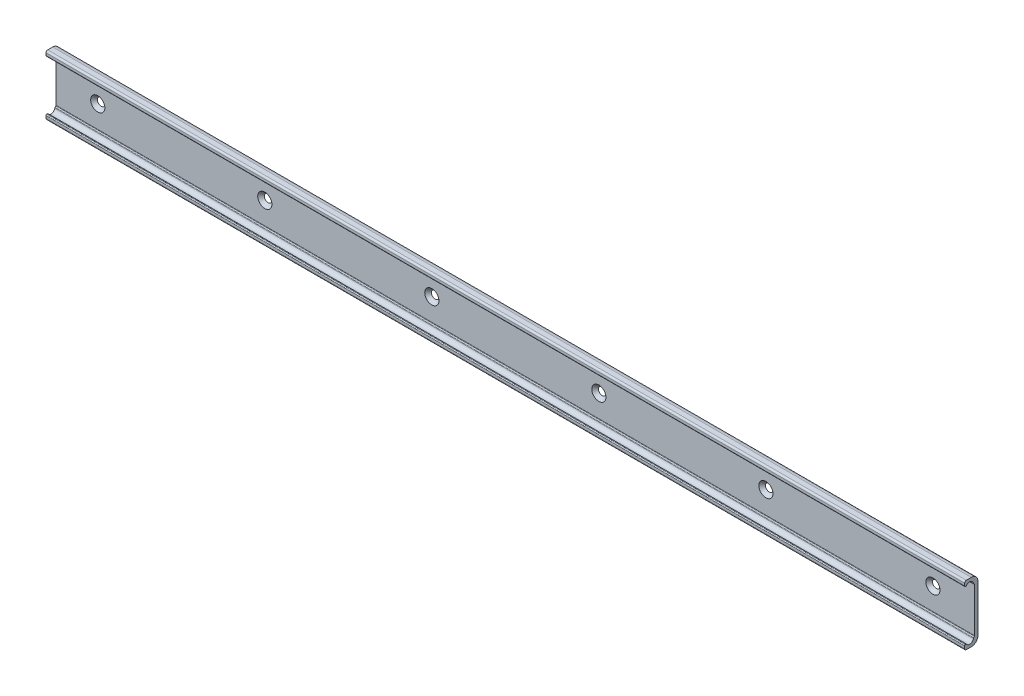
ISO-10303-21;
HEADER;
FILE_DESCRIPTION(('STEP AP214'),'2;1');
FILE_NAME('part.step','',(''),(''),'','','');
FILE_SCHEMA(('AUTOMOTIVE_DESIGN { 1 0 10303 214 1 1 1 1 }'));
ENDSEC;
DATA;
#1=APPLICATION_CONTEXT('core data for automotive mechanical design processes');
#2=APPLICATION_PROTOCOL_DEFINITION('international standard','automotive_design',2000,#1);
#3=PRODUCT_CONTEXT('',#1,'mechanical');
#4=PRODUCT('Part','Part','',(#3));
#5=PRODUCT_RELATED_PRODUCT_CATEGORY('part','',(#4));
#6=PRODUCT_DEFINITION_FORMATION('','',#4);
#7=PRODUCT_DEFINITION_CONTEXT('part definition',#1,'design');
#8=PRODUCT_DEFINITION('design','',#6,#7);
#9=PRODUCT_DEFINITION_SHAPE('','',#8);
#10=(LENGTH_UNIT() NAMED_UNIT(*) SI_UNIT(.MILLI.,.METRE.));
#11=(NAMED_UNIT(*) PLANE_ANGLE_UNIT() SI_UNIT($,.RADIAN.));
#12=(NAMED_UNIT(*) SI_UNIT($,.STERADIAN.) SOLID_ANGLE_UNIT());
#13=UNCERTAINTY_MEASURE_WITH_UNIT(LENGTH_MEASURE(1.E-05),#10,'distance_accuracy_value','');
#14=(GEOMETRIC_REPRESENTATION_CONTEXT(3) GLOBAL_UNCERTAINTY_ASSIGNED_CONTEXT((#13)) GLOBAL_UNIT_ASSIGNED_CONTEXT((#10,
#11,#12)) REPRESENTATION_CONTEXT('',''));
#15=CARTESIAN_POINT('',(0.,0.,0.));
#16=DIRECTION('',(0.,0.,1.));
#17=DIRECTION('',(1.,0.,0.));
#18=AXIS2_PLACEMENT_3D('',#15,#16,#17);
#19=CARTESIAN_POINT('',(525.,14.,4.));
#20=DIRECTION('',(-1.,0.,0.));
#21=DIRECTION('',(0.,0.,1.));
#22=AXIS2_PLACEMENT_3D('',#19,#20,#21);
#23=CYLINDRICAL_SURFACE('',#22,4.);
#24=CARTESIAN_POINT('',(-25.,14.,4.));
#25=DIRECTION('',(-1.,0.,0.));
#26=DIRECTION('',(0.,0.,1.));
#27=AXIS2_PLACEMENT_3D('',#24,#25,#26);
#28=CIRCLE('',#27,4.);
#29=CARTESIAN_POINT('',(-25.,18.,4.));
#30=VERTEX_POINT('',#29);
#31=CARTESIAN_POINT('',(-25.,14.,0.));
#32=VERTEX_POINT('',#31);
#33=EDGE_CURVE('E174',#30,#32,#28,.T.);
#34=ORIENTED_EDGE('',*,*,#33,.F.);
#35=DIRECTION('',(-1.,0.,0.));
#36=VECTOR('',#35,1.);
#37=CARTESIAN_POINT('',(525.,18.,4.));
#38=LINE('',#37,#36);
#39=CARTESIAN_POINT('',(525.,18.,4.));
#40=VERTEX_POINT('',#39);
#41=EDGE_CURVE('E9',#40,#30,#38,.T.);
#42=ORIENTED_EDGE('',*,*,#41,.F.);
#43=CARTESIAN_POINT('',(525.,14.,4.));
#44=DIRECTION('',(-1.,0.,0.));
#45=DIRECTION('',(0.,0.,1.));
#46=AXIS2_PLACEMENT_3D('',#43,#44,#45);
#47=CIRCLE('',#46,4.);
#48=CARTESIAN_POINT('',(525.,14.,0.));
#49=VERTEX_POINT('',#48);
#50=EDGE_CURVE('E176',#40,#49,#47,.T.);
#51=ORIENTED_EDGE('',*,*,#50,.T.);
#52=DIRECTION('',(-1.,0.,0.));
#53=VECTOR('',#52,1.);
#54=CARTESIAN_POINT('',(525.,14.,0.));
#55=LINE('',#54,#53);
#56=EDGE_CURVE('E17',#49,#32,#55,.T.);
#57=ORIENTED_EDGE('',*,*,#56,.T.);
#58=EDGE_LOOP('',(#34,#42,#51,#57));
#59=FACE_BOUND('',#58,.T.);
#60=ADVANCED_FACE('F14',(#59),#23,.T.);
#61=CARTESIAN_POINT('',(525.,18.,7.));
#62=DIRECTION('',(0.,1.,0.));
#63=DIRECTION('',(-1.,0.,0.));
#64=AXIS2_PLACEMENT_3D('',#61,#62,#63);
#65=PLANE('',#64);
#66=DIRECTION('',(0.,0.,-1.));
#67=VECTOR('',#66,1.);
#68=CARTESIAN_POINT('',(-25.,18.,7.));
#69=LINE('',#68,#67);
#70=CARTESIAN_POINT('',(-25.,18.,7.));
#71=VERTEX_POINT('',#70);
#72=EDGE_CURVE('E192',#71,#30,#69,.T.);
#73=ORIENTED_EDGE('',*,*,#72,.F.);
#74=DIRECTION('',(-1.,0.,0.));
#75=VECTOR('',#74,1.);
#76=CARTESIAN_POINT('',(525.,18.,7.));
#77=LINE('',#76,#75);
#78=CARTESIAN_POINT('',(525.,18.,7.));
#79=VERTEX_POINT('',#78);
#80=EDGE_CURVE('E22',#79,#71,#77,.T.);
#81=ORIENTED_EDGE('',*,*,#80,.F.);
#82=DIRECTION('',(0.,0.,-1.));
#83=VECTOR('',#82,1.);
#84=CARTESIAN_POINT('',(525.,18.,7.));
#85=LINE('',#84,#83);
#86=EDGE_CURVE('E181',#79,#40,#85,.T.);
#87=ORIENTED_EDGE('',*,*,#86,.T.);
#88=ORIENTED_EDGE('',*,*,#41,.T.);
#89=EDGE_LOOP('',(#73,#81,#87,#88));
#90=FACE_BOUND('',#89,.T.);
#91=ADVANCED_FACE('F448',(#90),#65,.T.);
#92=CARTESIAN_POINT('',(525.,17.,7.));
#93=DIRECTION('',(-1.,0.,0.));
#94=DIRECTION('',(0.,0.,1.));
#95=AXIS2_PLACEMENT_3D('',#92,#93,#94);
#96=CYLINDRICAL_SURFACE('',#95,1.);
#97=CARTESIAN_POINT('',(-25.,17.,7.));
#98=DIRECTION('',(-1.,0.,0.));
#99=DIRECTION('',(0.,0.,1.));
#100=AXIS2_PLACEMENT_3D('',#97,#98,#99);
#101=CIRCLE('',#100,1.);
#102=CARTESIAN_POINT('',(-25.,17.,8.));
#103=VERTEX_POINT('',#102);
#104=EDGE_CURVE('E258',#103,#71,#101,.T.);
#105=ORIENTED_EDGE('',*,*,#104,.F.);
#106=DIRECTION('',(-1.,0.,0.));
#107=VECTOR('',#106,1.);
#108=CARTESIAN_POINT('',(525.,17.,8.));
#109=LINE('',#108,#107);
#110=CARTESIAN_POINT('',(525.,17.,8.));
#111=VERTEX_POINT('',#110);
#112=EDGE_CURVE('E328',#111,#103,#109,.T.);
#113=ORIENTED_EDGE('',*,*,#112,.F.);
#114=CARTESIAN_POINT('',(525.,17.,7.));
#115=DIRECTION('',(-1.,0.,0.));
#116=DIRECTION('',(0.,0.,1.));
#117=AXIS2_PLACEMENT_3D('',#114,#115,#116);
#118=CIRCLE('',#117,1.);
#119=EDGE_CURVE('E324',#111,#79,#118,.T.);
#120=ORIENTED_EDGE('',*,*,#119,.T.);
#121=ORIENTED_EDGE('',*,*,#80,.T.);
#122=EDGE_LOOP('',(#105,#113,#120,#121));
#123=FACE_BOUND('',#122,.T.);
#124=ADVANCED_FACE('F453',(#123),#96,.T.);
#125=CARTESIAN_POINT('',(525.,15.55,8.));
#126=DIRECTION('',(0.,0.,1.));
#127=DIRECTION('',(1.,0.,0.));
#128=AXIS2_PLACEMENT_3D('',#125,#126,#127);
#129=PLANE('',#128);
#130=DIRECTION('',(0.,1.,0.));
#131=VECTOR('',#130,1.);
#132=CARTESIAN_POINT('',(-25.,15.55,8.));
#133=LINE('',#132,#131);
#134=CARTESIAN_POINT('',(-25.,15.55,8.));
#135=VERTEX_POINT('',#134);
#136=EDGE_CURVE('E255',#135,#103,#133,.T.);
#137=ORIENTED_EDGE('',*,*,#136,.F.);
#138=DIRECTION('',(-1.,0.,0.));
#139=VECTOR('',#138,1.);
#140=CARTESIAN_POINT('',(525.,15.55,8.));
#141=LINE('',#140,#139);
#142=CARTESIAN_POINT('',(525.,15.55,8.));
#143=VERTEX_POINT('',#142);
#144=EDGE_CURVE('E330',#143,#135,#141,.T.);
#145=ORIENTED_EDGE('',*,*,#144,.F.);
#146=DIRECTION('',(0.,1.,0.));
#147=VECTOR('',#146,1.);
#148=CARTESIAN_POINT('',(525.,15.55,8.));
#149=LINE('',#148,#147);
#150=EDGE_CURVE('E321',#143,#111,#149,.T.);
#151=ORIENTED_EDGE('',*,*,#150,.T.);
#152=ORIENTED_EDGE('',*,*,#112,.T.);
#153=EDGE_LOOP('',(#137,#145,#151,#152));
#154=FACE_BOUND('',#153,.T.);
#155=ADVANCED_FACE('F445',(#154),#129,.T.);
#156=CARTESIAN_POINT('',(525.,15.5499998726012,7.5));
#157=DIRECTION('',(-1.,0.,0.));
#158=DIRECTION('',(0.,0.,1.));
#159=AXIS2_PLACEMENT_3D('',#156,#157,#158);
#160=CYLINDRICAL_SURFACE('',#159,0.500000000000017);
#161=CARTESIAN_POINT('',(-25.,15.5499998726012,7.5));
#162=DIRECTION('',(-1.,0.,0.));
#163=DIRECTION('',(0.,0.,1.));
#164=AXIS2_PLACEMENT_3D('',#161,#162,#163);
#165=CIRCLE('',#164,0.500000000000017);
#166=CARTESIAN_POINT('',(-25.,15.0499998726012,7.49999995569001));
#167=VERTEX_POINT('',#166);
#168=EDGE_CURVE('E252',#167,#135,#165,.T.);
#169=ORIENTED_EDGE('',*,*,#168,.F.);
#170=DIRECTION('',(-1.,0.,0.));
#171=VECTOR('',#170,1.);
#172=CARTESIAN_POINT('',(525.,15.0499998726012,7.49999995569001));
#173=LINE('',#172,#171);
#174=CARTESIAN_POINT('',(525.,15.0499998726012,7.49999995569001));
#175=VERTEX_POINT('',#174);
#176=EDGE_CURVE('E332',#175,#167,#173,.T.);
#177=ORIENTED_EDGE('',*,*,#176,.F.);
#178=CARTESIAN_POINT('',(525.,15.5499998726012,7.5));
#179=DIRECTION('',(-1.,0.,0.));
#180=DIRECTION('',(0.,0.,1.));
#181=AXIS2_PLACEMENT_3D('',#178,#179,#180);
#182=CIRCLE('',#181,0.500000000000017);
#183=EDGE_CURVE('E318',#175,#143,#182,.T.);
#184=ORIENTED_EDGE('',*,*,#183,.T.);
#185=ORIENTED_EDGE('',*,*,#144,.T.);
#186=EDGE_LOOP('',(#169,#177,#184,#185));
#187=FACE_BOUND('',#186,.T.);
#188=ADVANCED_FACE('F441',(#187),#160,.T.);
#189=CARTESIAN_POINT('',(525.,15.0499998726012,7.49999995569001));
#190=DIRECTION('',(0.,-1.,0.));
#191=DIRECTION('',(1.,0.,0.));
#192=AXIS2_PLACEMENT_3D('',#189,#190,#191);
#193=PLANE('',#192);
#194=DIRECTION('',(0.,0.,1.));
#195=VECTOR('',#194,1.);
#196=CARTESIAN_POINT('',(-25.,15.0499998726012,7.49999995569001));
#197=LINE('',#196,#195);
#198=CARTESIAN_POINT('',(-25.,15.0499998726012,6.99185845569));
#199=VERTEX_POINT('',#198);
#200=EDGE_CURVE('E249',#199,#167,#197,.T.);
#201=ORIENTED_EDGE('',*,*,#200,.F.);
#202=DIRECTION('',(-1.,0.,0.));
#203=VECTOR('',#202,1.);
#204=CARTESIAN_POINT('',(525.,15.0499998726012,6.99185845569));
#205=LINE('',#204,#203);
#206=CARTESIAN_POINT('',(525.,15.0499998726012,6.99185845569));
#207=VERTEX_POINT('',#206);
#208=EDGE_CURVE('E334',#207,#199,#205,.T.);
#209=ORIENTED_EDGE('',*,*,#208,.F.);
#210=DIRECTION('',(0.,0.,1.));
#211=VECTOR('',#210,1.);
#212=CARTESIAN_POINT('',(525.,15.0499998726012,7.49999995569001));
#213=LINE('',#212,#211);
#214=EDGE_CURVE('E315',#207,#175,#213,.T.);
#215=ORIENTED_EDGE('',*,*,#214,.T.);
#216=ORIENTED_EDGE('',*,*,#176,.T.);
#217=EDGE_LOOP('',(#201,#209,#215,#216));
#218=FACE_BOUND('',#217,.T.);
#219=ADVANCED_FACE('F437',(#218),#193,.T.);
#220=CARTESIAN_POINT('',(525.,13.899999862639,4.99999993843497));
#221=DIRECTION('',(-1.,0.,0.));
#222=DIRECTION('',(0.,0.,1.));
#223=AXIS2_PLACEMENT_3D('',#220,#221,#222);
#224=CYLINDRICAL_SURFACE('',#223,2.30000008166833);
#225=CARTESIAN_POINT('',(-25.,13.899999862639,4.99999993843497));
#226=DIRECTION('',(1.,0.,0.));
#227=DIRECTION('',(0.,0.,1.));
#228=AXIS2_PLACEMENT_3D('',#225,#226,#227);
#229=CIRCLE('',#228,2.30000008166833);
#230=CARTESIAN_POINT('',(-25.,14.3822673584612,2.75112945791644));
#231=VERTEX_POINT('',#230);
#232=EDGE_CURVE('E246',#231,#199,#229,.T.);
#233=ORIENTED_EDGE('',*,*,#232,.F.);
#234=DIRECTION('',(-1.,0.,0.));
#235=VECTOR('',#234,1.);
#236=CARTESIAN_POINT('',(525.,14.3822673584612,2.75112945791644));
#237=LINE('',#236,#235);
#238=CARTESIAN_POINT('',(525.,14.3822673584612,2.75112945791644));
#239=VERTEX_POINT('',#238);
#240=EDGE_CURVE('E336',#239,#231,#237,.T.);
#241=ORIENTED_EDGE('',*,*,#240,.F.);
#242=CARTESIAN_POINT('',(525.,13.899999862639,4.99999993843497));
#243=DIRECTION('',(1.,0.,0.));
#244=DIRECTION('',(0.,0.,1.));
#245=AXIS2_PLACEMENT_3D('',#242,#243,#244);
#246=CIRCLE('',#245,2.30000008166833);
#247=EDGE_CURVE('E312',#239,#207,#246,.T.);
#248=ORIENTED_EDGE('',*,*,#247,.T.);
#249=ORIENTED_EDGE('',*,*,#208,.T.);
#250=EDGE_LOOP('',(#233,#241,#248,#249));
#251=FACE_BOUND('',#250,.T.);
#252=ADVANCED_FACE('F433',(#251),#224,.F.);
#253=CARTESIAN_POINT('',(525.,14.2647621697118,2.72240648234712));
#254=DIRECTION('',(0.,-0.237449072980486,0.971399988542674));
#255=DIRECTION('',(0.,0.971399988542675,0.237449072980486));
#256=AXIS2_PLACEMENT_3D('',#253,#254,#255);
#257=PLANE('',#256);
#258=DIRECTION('',(0.,0.971399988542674,0.237449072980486));
#259=VECTOR('',#258,1.);
#260=CARTESIAN_POINT('',(-25.,14.2647621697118,2.72240648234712));
#261=LINE('',#260,#259);
#262=CARTESIAN_POINT('',(-25.,14.2647621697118,2.72240648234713));
#263=VERTEX_POINT('',#262);
#264=EDGE_CURVE('E243',#263,#231,#261,.T.);
#265=ORIENTED_EDGE('',*,*,#264,.F.);
#266=DIRECTION('',(-1.,0.,0.));
#267=VECTOR('',#266,1.);
#268=CARTESIAN_POINT('',(525.,14.2647621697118,2.72240648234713));
#269=LINE('',#268,#267);
#270=CARTESIAN_POINT('',(525.,14.2647621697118,2.72240648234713));
#271=VERTEX_POINT('',#270);
#272=EDGE_CURVE('E338',#271,#263,#269,.T.);
#273=ORIENTED_EDGE('',*,*,#272,.F.);
#274=DIRECTION('',(0.,0.971399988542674,0.237449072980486));
#275=VECTOR('',#274,1.);
#276=CARTESIAN_POINT('',(525.,14.2647621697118,2.72240648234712));
#277=LINE('',#276,#275);
#278=EDGE_CURVE('E309',#271,#239,#277,.T.);
#279=ORIENTED_EDGE('',*,*,#278,.T.);
#280=ORIENTED_EDGE('',*,*,#240,.T.);
#281=EDGE_LOOP('',(#265,#273,#279,#280));
#282=FACE_BOUND('',#281,.T.);
#283=ADVANCED_FACE('F429',(#282),#257,.T.);
#284=CARTESIAN_POINT('',(525.,14.3343843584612,2.2272774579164));
#285=DIRECTION('',(-1.,0.,0.));
#286=DIRECTION('',(0.,0.,1.));
#287=AXIS2_PLACEMENT_3D('',#284,#285,#286);
#288=CYLINDRICAL_SURFACE('',#287,0.49999999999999);
#289=CARTESIAN_POINT('',(-25.,14.3343843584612,2.2272774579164));
#290=DIRECTION('',(-1.,0.,0.));
#291=DIRECTION('',(0.,0.,1.));
#292=AXIS2_PLACEMENT_3D('',#289,#290,#291);
#293=CIRCLE('',#292,0.49999999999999);
#294=CARTESIAN_POINT('',(-25.,13.980830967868,2.58083084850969));
#295=VERTEX_POINT('',#294);
#296=EDGE_CURVE('E240',#295,#263,#293,.T.);
#297=ORIENTED_EDGE('',*,*,#296,.F.);
#298=DIRECTION('',(-1.,0.,0.));
#299=VECTOR('',#298,1.);
#300=CARTESIAN_POINT('',(525.,13.980830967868,2.58083084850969));
#301=LINE('',#300,#299);
#302=CARTESIAN_POINT('',(525.,13.980830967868,2.58083084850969));
#303=VERTEX_POINT('',#302);
#304=EDGE_CURVE('E340',#303,#295,#301,.T.);
#305=ORIENTED_EDGE('',*,*,#304,.F.);
#306=CARTESIAN_POINT('',(525.,14.3343843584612,2.2272774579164));
#307=DIRECTION('',(-1.,0.,0.));
#308=DIRECTION('',(0.,0.,1.));
#309=AXIS2_PLACEMENT_3D('',#306,#307,#308);
#310=CIRCLE('',#309,0.49999999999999);
#311=EDGE_CURVE('E306',#303,#271,#310,.T.);
#312=ORIENTED_EDGE('',*,*,#311,.T.);
#313=ORIENTED_EDGE('',*,*,#272,.T.);
#314=EDGE_LOOP('',(#297,#305,#312,#313));
#315=FACE_BOUND('',#314,.T.);
#316=ADVANCED_FACE('F425',(#315),#288,.T.);
#317=CARTESIAN_POINT('',(525.,13.5464468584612,2.1464464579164));
#318=DIRECTION('',(0.,-0.707107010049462,0.707106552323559));
#319=DIRECTION('',(0.,0.707106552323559,0.707107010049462));
#320=AXIS2_PLACEMENT_3D('',#317,#318,#319);
#321=PLANE('',#320);
#322=DIRECTION('',(0.,0.707106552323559,0.707107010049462));
#323=VECTOR('',#322,1.);
#324=CARTESIAN_POINT('',(-25.,13.5464468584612,2.1464464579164));
#325=LINE('',#324,#323);
#326=CARTESIAN_POINT('',(-25.,13.5464468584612,2.1464464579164));
#327=VERTEX_POINT('',#326);
#328=EDGE_CURVE('E237',#327,#295,#325,.T.);
#329=ORIENTED_EDGE('',*,*,#328,.F.);
#330=DIRECTION('',(-1.,0.,0.));
#331=VECTOR('',#330,1.);
#332=CARTESIAN_POINT('',(525.,13.5464468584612,2.1464464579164));
#333=LINE('',#332,#331);
#334=CARTESIAN_POINT('',(525.,13.5464468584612,2.1464464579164));
#335=VERTEX_POINT('',#334);
#336=EDGE_CURVE('E342',#335,#327,#333,.T.);
#337=ORIENTED_EDGE('',*,*,#336,.F.);
#338=DIRECTION('',(0.,0.707106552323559,0.707107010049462));
#339=VECTOR('',#338,1.);
#340=CARTESIAN_POINT('',(525.,13.5464468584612,2.1464464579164));
#341=LINE('',#340,#339);
#342=EDGE_CURVE('E303',#335,#303,#341,.T.);
#343=ORIENTED_EDGE('',*,*,#342,.T.);
#344=ORIENTED_EDGE('',*,*,#304,.T.);
#345=EDGE_LOOP('',(#329,#337,#343,#344));
#346=FACE_BOUND('',#345,.T.);
#347=ADVANCED_FACE('F421',(#346),#321,.T.);
#348=CARTESIAN_POINT('',(525.,13.1928934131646,2.49999990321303));
#349=DIRECTION('',(-1.,0.,0.));
#350=DIRECTION('',(0.,0.,1.));
#351=AXIS2_PLACEMENT_3D('',#348,#349,#350);
#352=CYLINDRICAL_SURFACE('',#351,0.500000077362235);
#353=CARTESIAN_POINT('',(-25.,13.1928934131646,2.49999990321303));
#354=DIRECTION('',(1.,0.,0.));
#355=DIRECTION('',(0.,0.,1.));
#356=AXIS2_PLACEMENT_3D('',#353,#354,#355);
#357=CIRCLE('',#356,0.500000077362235);
#358=CARTESIAN_POINT('',(-25.,13.1928934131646,1.9999998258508));
#359=VERTEX_POINT('',#358);
#360=EDGE_CURVE('E234',#359,#327,#357,.T.);
#361=ORIENTED_EDGE('',*,*,#360,.F.);
#362=DIRECTION('',(-1.,0.,0.));
#363=VECTOR('',#362,1.);
#364=CARTESIAN_POINT('',(525.,13.1928934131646,1.9999998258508));
#365=LINE('',#364,#363);
#366=CARTESIAN_POINT('',(525.,13.1928934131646,1.9999998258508));
#367=VERTEX_POINT('',#366);
#368=EDGE_CURVE('E344',#367,#359,#365,.T.);
#369=ORIENTED_EDGE('',*,*,#368,.F.);
#370=CARTESIAN_POINT('',(525.,13.1928934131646,2.49999990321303));
#371=DIRECTION('',(1.,0.,0.));
#372=DIRECTION('',(0.,0.,1.));
#373=AXIS2_PLACEMENT_3D('',#370,#371,#372);
#374=CIRCLE('',#373,0.500000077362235);
#375=EDGE_CURVE('E300',#367,#335,#374,.T.);
#376=ORIENTED_EDGE('',*,*,#375,.T.);
#377=ORIENTED_EDGE('',*,*,#336,.T.);
#378=EDGE_LOOP('',(#361,#369,#376,#377));
#379=FACE_BOUND('',#378,.T.);
#380=ADVANCED_FACE('F417',(#379),#352,.F.);
#381=CARTESIAN_POINT('',(525.,-13.1928934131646,1.9999998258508));
#382=DIRECTION('',(0.,0.,1.));
#383=DIRECTION('',(0.,1.,0.));
#384=AXIS2_PLACEMENT_3D('',#381,#382,#383);
#385=PLANE('',#384);
#386=CARTESIAN_POINT('',(500.,0.,1.9999998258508));
#387=DIRECTION('',(0.,0.,1.));
#388=DIRECTION('',(0.,1.,0.));
#389=AXIS2_PLACEMENT_3D('',#386,#387,#388);
#390=CIRCLE('',#389,4.25);
#391=CARTESIAN_POINT('',(500.,4.25,1.99999982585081));
#392=VERTEX_POINT('',#391);
#393=EDGE_CURVE('E732',#392,#392,#390,.T.);
#394=ORIENTED_EDGE('',*,*,#393,.F.);
#395=EDGE_LOOP('',(#394));
#396=FACE_BOUND('',#395,.T.);
#397=CARTESIAN_POINT('',(400.,0.,1.9999998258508));
#398=DIRECTION('',(0.,0.,1.));
#399=DIRECTION('',(0.,1.,0.));
#400=AXIS2_PLACEMENT_3D('',#397,#398,#399);
#401=CIRCLE('',#400,4.25);
#402=CARTESIAN_POINT('',(400.,4.25,1.99999982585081));
#403=VERTEX_POINT('',#402);
#404=EDGE_CURVE('E736',#403,#403,#401,.T.);
#405=ORIENTED_EDGE('',*,*,#404,.F.);
#406=EDGE_LOOP('',(#405));
#407=FACE_BOUND('',#406,.T.);
#408=CARTESIAN_POINT('',(300.,0.,1.9999998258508));
#409=DIRECTION('',(0.,0.,1.));
#410=DIRECTION('',(0.,1.,0.));
#411=AXIS2_PLACEMENT_3D('',#408,#409,#410);
#412=CIRCLE('',#411,4.25);
#413=CARTESIAN_POINT('',(300.,4.25,1.99999982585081));
#414=VERTEX_POINT('',#413);
#415=EDGE_CURVE('E745',#414,#414,#412,.T.);
#416=ORIENTED_EDGE('',*,*,#415,.F.);
#417=EDGE_LOOP('',(#416));
#418=FACE_BOUND('',#417,.T.);
#419=CARTESIAN_POINT('',(200.,0.,1.9999998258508));
#420=DIRECTION('',(0.,0.,1.));
#421=DIRECTION('',(0.,1.,0.));
#422=AXIS2_PLACEMENT_3D('',#419,#420,#421);
#423=CIRCLE('',#422,4.25);
#424=CARTESIAN_POINT('',(200.,4.25,1.99999982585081));
#425=VERTEX_POINT('',#424);
#426=EDGE_CURVE('E751',#425,#425,#423,.T.);
#427=ORIENTED_EDGE('',*,*,#426,.F.);
#428=EDGE_LOOP('',(#427));
#429=FACE_BOUND('',#428,.T.);
#430=CARTESIAN_POINT('',(100.,0.,1.9999998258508));
#431=DIRECTION('',(0.,0.,1.));
#432=DIRECTION('',(0.,1.,0.));
#433=AXIS2_PLACEMENT_3D('',#430,#431,#432);
#434=CIRCLE('',#433,4.25);
#435=CARTESIAN_POINT('',(100.,4.25,1.99999982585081));
#436=VERTEX_POINT('',#435);
#437=EDGE_CURVE('E757',#436,#436,#434,.T.);
#438=ORIENTED_EDGE('',*,*,#437,.F.);
#439=EDGE_LOOP('',(#438));
#440=FACE_BOUND('',#439,.T.);
#441=CARTESIAN_POINT('',(0.,0.,1.9999998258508));
#442=DIRECTION('',(0.,0.,1.));
#443=DIRECTION('',(0.,1.,0.));
#444=AXIS2_PLACEMENT_3D('',#441,#442,#443);
#445=CIRCLE('',#444,4.25);
#446=CARTESIAN_POINT('',(0.,4.25,1.99999982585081));
#447=VERTEX_POINT('',#446);
#448=EDGE_CURVE('E196',#447,#447,#445,.T.);
#449=ORIENTED_EDGE('',*,*,#448,.F.);
#450=EDGE_LOOP('',(#449));
#451=FACE_BOUND('',#450,.T.);
#452=DIRECTION('',(0.,1.,0.));
#453=VECTOR('',#452,1.);
#454=CARTESIAN_POINT('',(-25.,-13.1928934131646,1.9999998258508));
#455=LINE('',#454,#453);
#456=CARTESIAN_POINT('',(-25.,-13.1928934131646,1.9999998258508));
#457=VERTEX_POINT('',#456);
#458=EDGE_CURVE('E231',#457,#359,#455,.T.);
#459=ORIENTED_EDGE('',*,*,#458,.F.);
#460=DIRECTION('',(-1.,0.,0.));
#461=VECTOR('',#460,1.);
#462=CARTESIAN_POINT('',(525.,-13.1928934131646,1.9999998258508));
#463=LINE('',#462,#461);
#464=CARTESIAN_POINT('',(525.,-13.1928934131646,1.9999998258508));
#465=VERTEX_POINT('',#464);
#466=EDGE_CURVE('E346',#465,#457,#463,.T.);
#467=ORIENTED_EDGE('',*,*,#466,.F.);
#468=DIRECTION('',(0.,1.,0.));
#469=VECTOR('',#468,1.);
#470=CARTESIAN_POINT('',(525.,-13.1928934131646,1.9999998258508));
#471=LINE('',#470,#469);
#472=EDGE_CURVE('E297',#465,#367,#471,.T.);
#473=ORIENTED_EDGE('',*,*,#472,.T.);
#474=ORIENTED_EDGE('',*,*,#368,.T.);
#475=EDGE_LOOP('',(#459,#467,#473,#474));
#476=FACE_BOUND('',#475,.T.);
#477=ADVANCED_FACE('F413',(#396,#407,#418,#429,#440,#451,#476),#385,.T.);
#478=CARTESIAN_POINT('',(525.,-13.1928934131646,2.49999990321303));
#479=DIRECTION('',(-1.,0.,0.));
#480=DIRECTION('',(0.,0.,1.));
#481=AXIS2_PLACEMENT_3D('',#478,#479,#480);
#482=CYLINDRICAL_SURFACE('',#481,0.500000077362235);
#483=CARTESIAN_POINT('',(-25.,-13.1928934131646,2.49999990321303));
#484=DIRECTION('',(1.,0.,0.));
#485=DIRECTION('',(0.,0.,-1.));
#486=AXIS2_PLACEMENT_3D('',#483,#484,#485);
#487=CIRCLE('',#486,0.500000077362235);
#488=CARTESIAN_POINT('',(-25.,-13.5464468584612,2.1464464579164));
#489=VERTEX_POINT('',#488);
#490=EDGE_CURVE('E228',#489,#457,#487,.T.);
#491=ORIENTED_EDGE('',*,*,#490,.F.);
#492=DIRECTION('',(-1.,0.,0.));
#493=VECTOR('',#492,1.);
#494=CARTESIAN_POINT('',(525.,-13.5464468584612,2.1464464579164));
#495=LINE('',#494,#493);
#496=CARTESIAN_POINT('',(525.,-13.5464468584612,2.1464464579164));
#497=VERTEX_POINT('',#496);
#498=EDGE_CURVE('E348',#497,#489,#495,.T.);
#499=ORIENTED_EDGE('',*,*,#498,.F.);
#500=CARTESIAN_POINT('',(525.,-13.1928934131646,2.49999990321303));
#501=DIRECTION('',(1.,0.,0.));
#502=DIRECTION('',(0.,0.,-1.));
#503=AXIS2_PLACEMENT_3D('',#500,#501,#502);
#504=CIRCLE('',#503,0.500000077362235);
#505=EDGE_CURVE('E294',#497,#465,#504,.T.);
#506=ORIENTED_EDGE('',*,*,#505,.T.);
#507=ORIENTED_EDGE('',*,*,#466,.T.);
#508=EDGE_LOOP('',(#491,#499,#506,#507));
#509=FACE_BOUND('',#508,.T.);
#510=ADVANCED_FACE('F409',(#509),#482,.F.);
#511=CARTESIAN_POINT('',(525.,-13.5464468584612,2.1464464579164));
#512=DIRECTION('',(0.,0.707107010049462,0.707106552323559));
#513=DIRECTION('',(0.,0.707106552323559,-0.707107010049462));
#514=AXIS2_PLACEMENT_3D('',#511,#512,#513);
#515=PLANE('',#514);
#516=DIRECTION('',(0.,0.707106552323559,-0.707107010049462));
#517=VECTOR('',#516,1.);
#518=CARTESIAN_POINT('',(-25.,-13.5464468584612,2.1464464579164));
#519=LINE('',#518,#517);
#520=CARTESIAN_POINT('',(-25.,-13.980830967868,2.58083084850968));
#521=VERTEX_POINT('',#520);
#522=EDGE_CURVE('E225',#521,#489,#519,.T.);
#523=ORIENTED_EDGE('',*,*,#522,.F.);
#524=DIRECTION('',(-1.,0.,0.));
#525=VECTOR('',#524,1.);
#526=CARTESIAN_POINT('',(525.,-13.980830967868,2.58083084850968));
#527=LINE('',#526,#525);
#528=CARTESIAN_POINT('',(525.,-13.980830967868,2.58083084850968));
#529=VERTEX_POINT('',#528);
#530=EDGE_CURVE('E350',#529,#521,#527,.T.);
#531=ORIENTED_EDGE('',*,*,#530,.F.);
#532=DIRECTION('',(0.,0.707106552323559,-0.707107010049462));
#533=VECTOR('',#532,1.);
#534=CARTESIAN_POINT('',(525.,-13.5464468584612,2.1464464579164));
#535=LINE('',#534,#533);
#536=EDGE_CURVE('E291',#529,#497,#535,.T.);
#537=ORIENTED_EDGE('',*,*,#536,.T.);
#538=ORIENTED_EDGE('',*,*,#498,.T.);
#539=EDGE_LOOP('',(#523,#531,#537,#538));
#540=FACE_BOUND('',#539,.T.);
#541=ADVANCED_FACE('F405',(#540),#515,.T.);
#542=CARTESIAN_POINT('',(525.,-14.3343843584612,2.22727745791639));
#543=DIRECTION('',(-1.,0.,0.));
#544=DIRECTION('',(0.,0.,1.));
#545=AXIS2_PLACEMENT_3D('',#542,#543,#544);
#546=CYLINDRICAL_SURFACE('',#545,0.49999999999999);
#547=CARTESIAN_POINT('',(-25.,-14.3343843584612,2.22727745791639));
#548=DIRECTION('',(-1.,0.,0.));
#549=DIRECTION('',(0.,0.,-1.));
#550=AXIS2_PLACEMENT_3D('',#547,#548,#549);
#551=CIRCLE('',#550,0.49999999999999);
#552=CARTESIAN_POINT('',(-25.,-14.2647621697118,2.72240648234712));
#553=VERTEX_POINT('',#552);
#554=EDGE_CURVE('E222',#553,#521,#551,.T.);
#555=ORIENTED_EDGE('',*,*,#554,.F.);
#556=DIRECTION('',(-1.,0.,0.));
#557=VECTOR('',#556,1.);
#558=CARTESIAN_POINT('',(525.,-14.2647621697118,2.72240648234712));
#559=LINE('',#558,#557);
#560=CARTESIAN_POINT('',(525.,-14.2647621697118,2.72240648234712));
#561=VERTEX_POINT('',#560);
#562=EDGE_CURVE('E352',#561,#553,#559,.T.);
#563=ORIENTED_EDGE('',*,*,#562,.F.);
#564=CARTESIAN_POINT('',(525.,-14.3343843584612,2.22727745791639));
#565=DIRECTION('',(-1.,0.,0.));
#566=DIRECTION('',(0.,0.,-1.));
#567=AXIS2_PLACEMENT_3D('',#564,#565,#566);
#568=CIRCLE('',#567,0.49999999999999);
#569=EDGE_CURVE('E288',#561,#529,#568,.T.);
#570=ORIENTED_EDGE('',*,*,#569,.T.);
#571=ORIENTED_EDGE('',*,*,#530,.T.);
#572=EDGE_LOOP('',(#555,#563,#570,#571));
#573=FACE_BOUND('',#572,.T.);
#574=ADVANCED_FACE('F401',(#573),#546,.T.);
#575=CARTESIAN_POINT('',(525.,-14.2647621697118,2.72240648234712));
#576=DIRECTION('',(0.,0.237449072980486,0.971399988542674));
#577=DIRECTION('',(0.,0.971399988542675,-0.237449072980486));
#578=AXIS2_PLACEMENT_3D('',#575,#576,#577);
#579=PLANE('',#578);
#580=DIRECTION('',(0.,0.971399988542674,-0.237449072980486));
#581=VECTOR('',#580,1.);
#582=CARTESIAN_POINT('',(-25.,-14.2647621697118,2.72240648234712));
#583=LINE('',#582,#581);
#584=CARTESIAN_POINT('',(-25.,-14.3822673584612,2.75112945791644));
#585=VERTEX_POINT('',#584);
#586=EDGE_CURVE('E219',#585,#553,#583,.T.);
#587=ORIENTED_EDGE('',*,*,#586,.F.);
#588=DIRECTION('',(-1.,0.,0.));
#589=VECTOR('',#588,1.);
#590=CARTESIAN_POINT('',(525.,-14.3822673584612,2.75112945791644));
#591=LINE('',#590,#589);
#592=CARTESIAN_POINT('',(525.,-14.3822673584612,2.75112945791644));
#593=VERTEX_POINT('',#592);
#594=EDGE_CURVE('E354',#593,#585,#591,.T.);
#595=ORIENTED_EDGE('',*,*,#594,.F.);
#596=DIRECTION('',(0.,0.971399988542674,-0.237449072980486));
#597=VECTOR('',#596,1.);
#598=CARTESIAN_POINT('',(525.,-14.2647621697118,2.72240648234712));
#599=LINE('',#598,#597);
#600=EDGE_CURVE('E285',#593,#561,#599,.T.);
#601=ORIENTED_EDGE('',*,*,#600,.T.);
#602=ORIENTED_EDGE('',*,*,#562,.T.);
#603=EDGE_LOOP('',(#587,#595,#601,#602));
#604=FACE_BOUND('',#603,.T.);
#605=ADVANCED_FACE('F397',(#604),#579,.T.);
#606=CARTESIAN_POINT('',(525.,-13.899999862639,4.99999993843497));
#607=DIRECTION('',(-1.,0.,0.));
#608=DIRECTION('',(0.,0.,1.));
#609=AXIS2_PLACEMENT_3D('',#606,#607,#608);
#610=CYLINDRICAL_SURFACE('',#609,2.30000008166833);
#611=CARTESIAN_POINT('',(-25.,-13.899999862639,4.99999993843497));
#612=DIRECTION('',(1.,0.,0.));
#613=DIRECTION('',(0.,0.,-1.));
#614=AXIS2_PLACEMENT_3D('',#611,#612,#613);
#615=CIRCLE('',#614,2.30000008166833);
#616=CARTESIAN_POINT('',(-25.,-15.0499998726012,6.99185845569));
#617=VERTEX_POINT('',#616);
#618=EDGE_CURVE('E216',#617,#585,#615,.T.);
#619=ORIENTED_EDGE('',*,*,#618,.F.);
#620=DIRECTION('',(-1.,0.,0.));
#621=VECTOR('',#620,1.);
#622=CARTESIAN_POINT('',(525.,-15.0499998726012,6.99185845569));
#623=LINE('',#622,#621);
#624=CARTESIAN_POINT('',(525.,-15.0499998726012,6.99185845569));
#625=VERTEX_POINT('',#624);
#626=EDGE_CURVE('E356',#625,#617,#623,.T.);
#627=ORIENTED_EDGE('',*,*,#626,.F.);
#628=CARTESIAN_POINT('',(525.,-13.899999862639,4.99999993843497));
#629=DIRECTION('',(1.,0.,0.));
#630=DIRECTION('',(0.,0.,-1.));
#631=AXIS2_PLACEMENT_3D('',#628,#629,#630);
#632=CIRCLE('',#631,2.30000008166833);
#633=EDGE_CURVE('E282',#625,#593,#632,.T.);
#634=ORIENTED_EDGE('',*,*,#633,.T.);
#635=ORIENTED_EDGE('',*,*,#594,.T.);
#636=EDGE_LOOP('',(#619,#627,#634,#635));
#637=FACE_BOUND('',#636,.T.);
#638=ADVANCED_FACE('F393',(#637),#610,.F.);
#639=CARTESIAN_POINT('',(525.,-15.0499998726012,7.49999995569));
#640=DIRECTION('',(0.,1.,0.));
#641=DIRECTION('',(-1.,0.,0.));
#642=AXIS2_PLACEMENT_3D('',#639,#640,#641);
#643=PLANE('',#642);
#644=DIRECTION('',(0.,0.,-1.));
#645=VECTOR('',#644,1.);
#646=CARTESIAN_POINT('',(-25.,-15.0499998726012,7.49999995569));
#647=LINE('',#646,#645);
#648=CARTESIAN_POINT('',(-25.,-15.0499998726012,7.49999995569));
#649=VERTEX_POINT('',#648);
#650=EDGE_CURVE('E213',#649,#617,#647,.T.);
#651=ORIENTED_EDGE('',*,*,#650,.F.);
#652=DIRECTION('',(-1.,0.,0.));
#653=VECTOR('',#652,1.);
#654=CARTESIAN_POINT('',(525.,-15.0499998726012,7.49999995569));
#655=LINE('',#654,#653);
#656=CARTESIAN_POINT('',(525.,-15.0499998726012,7.49999995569));
#657=VERTEX_POINT('',#656);
#658=EDGE_CURVE('E358',#657,#649,#655,.T.);
#659=ORIENTED_EDGE('',*,*,#658,.F.);
#660=DIRECTION('',(0.,0.,-1.));
#661=VECTOR('',#660,1.);
#662=CARTESIAN_POINT('',(525.,-15.0499998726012,7.49999995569));
#663=LINE('',#662,#661);
#664=EDGE_CURVE('E279',#657,#625,#663,.T.);
#665=ORIENTED_EDGE('',*,*,#664,.T.);
#666=ORIENTED_EDGE('',*,*,#626,.T.);
#667=EDGE_LOOP('',(#651,#659,#665,#666));
#668=FACE_BOUND('',#667,.T.);
#669=ADVANCED_FACE('F389',(#668),#643,.T.);
#670=CARTESIAN_POINT('',(525.,-15.5499998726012,7.5));
#671=DIRECTION('',(-1.,0.,0.));
#672=DIRECTION('',(0.,0.,1.));
#673=AXIS2_PLACEMENT_3D('',#670,#671,#672);
#674=CYLINDRICAL_SURFACE('',#673,0.500000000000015);
#675=CARTESIAN_POINT('',(-25.,-15.5499998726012,7.5));
#676=DIRECTION('',(-1.,0.,0.));
#677=DIRECTION('',(0.,0.,-1.));
#678=AXIS2_PLACEMENT_3D('',#675,#676,#677);
#679=CIRCLE('',#678,0.500000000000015);
#680=CARTESIAN_POINT('',(-25.,-15.55,8.));
#681=VERTEX_POINT('',#680);
#682=EDGE_CURVE('E210',#681,#649,#679,.T.);
#683=ORIENTED_EDGE('',*,*,#682,.F.);
#684=DIRECTION('',(-1.,0.,0.));
#685=VECTOR('',#684,1.);
#686=CARTESIAN_POINT('',(525.,-15.55,8.));
#687=LINE('',#686,#685);
#688=CARTESIAN_POINT('',(525.,-15.55,8.));
#689=VERTEX_POINT('',#688);
#690=EDGE_CURVE('E360',#689,#681,#687,.T.);
#691=ORIENTED_EDGE('',*,*,#690,.F.);
#692=CARTESIAN_POINT('',(525.,-15.5499998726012,7.5));
#693=DIRECTION('',(-1.,0.,0.));
#694=DIRECTION('',(0.,0.,-1.));
#695=AXIS2_PLACEMENT_3D('',#692,#693,#694);
#696=CIRCLE('',#695,0.500000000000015);
#697=EDGE_CURVE('E276',#689,#657,#696,.T.);
#698=ORIENTED_EDGE('',*,*,#697,.T.);
#699=ORIENTED_EDGE('',*,*,#658,.T.);
#700=EDGE_LOOP('',(#683,#691,#698,#699));
#701=FACE_BOUND('',#700,.T.);
#702=ADVANCED_FACE('F385',(#701),#674,.T.);
#703=CARTESIAN_POINT('',(525.,-15.55,8.));
#704=DIRECTION('',(0.,0.,1.));
#705=DIRECTION('',(1.,0.,0.));
#706=AXIS2_PLACEMENT_3D('',#703,#704,#705);
#707=PLANE('',#706);
#708=DIRECTION('',(0.,1.,0.));
#709=VECTOR('',#708,1.);
#710=CARTESIAN_POINT('',(-25.,-15.55,8.));
#711=LINE('',#710,#709);
#712=CARTESIAN_POINT('',(-25.,-17.,8.));
#713=VERTEX_POINT('',#712);
#714=EDGE_CURVE('E207',#713,#681,#711,.T.);
#715=ORIENTED_EDGE('',*,*,#714,.F.);
#716=DIRECTION('',(-1.,0.,0.));
#717=VECTOR('',#716,1.);
#718=CARTESIAN_POINT('',(525.,-17.,8.));
#719=LINE('',#718,#717);
#720=CARTESIAN_POINT('',(525.,-17.,8.));
#721=VERTEX_POINT('',#720);
#722=EDGE_CURVE('E362',#721,#713,#719,.T.);
#723=ORIENTED_EDGE('',*,*,#722,.F.);
#724=DIRECTION('',(0.,1.,0.));
#725=VECTOR('',#724,1.);
#726=CARTESIAN_POINT('',(525.,-15.55,8.));
#727=LINE('',#726,#725);
#728=EDGE_CURVE('E273',#721,#689,#727,.T.);
#729=ORIENTED_EDGE('',*,*,#728,.T.);
#730=ORIENTED_EDGE('',*,*,#690,.T.);
#731=EDGE_LOOP('',(#715,#723,#729,#730));
#732=FACE_BOUND('',#731,.T.);
#733=ADVANCED_FACE('F381',(#732),#707,.T.);
#734=CARTESIAN_POINT('',(525.,-17.,7.));
#735=DIRECTION('',(-1.,0.,0.));
#736=DIRECTION('',(0.,0.,1.));
#737=AXIS2_PLACEMENT_3D('',#734,#735,#736);
#738=CYLINDRICAL_SURFACE('',#737,1.);
#739=CARTESIAN_POINT('',(-25.,-17.,7.));
#740=DIRECTION('',(-1.,0.,0.));
#741=DIRECTION('',(0.,0.,-1.));
#742=AXIS2_PLACEMENT_3D('',#739,#740,#741);
#743=CIRCLE('',#742,1.);
#744=CARTESIAN_POINT('',(-25.,-18.,7.));
#745=VERTEX_POINT('',#744);
#746=EDGE_CURVE('E204',#745,#713,#743,.T.);
#747=ORIENTED_EDGE('',*,*,#746,.F.);
#748=DIRECTION('',(-1.,0.,0.));
#749=VECTOR('',#748,1.);
#750=CARTESIAN_POINT('',(525.,-18.,7.));
#751=LINE('',#750,#749);
#752=CARTESIAN_POINT('',(525.,-18.,7.));
#753=VERTEX_POINT('',#752);
#754=EDGE_CURVE('E364',#753,#745,#751,.T.);
#755=ORIENTED_EDGE('',*,*,#754,.F.);
#756=CARTESIAN_POINT('',(525.,-17.,7.));
#757=DIRECTION('',(-1.,0.,0.));
#758=DIRECTION('',(0.,0.,-1.));
#759=AXIS2_PLACEMENT_3D('',#756,#757,#758);
#760=CIRCLE('',#759,1.);
#761=EDGE_CURVE('E270',#753,#721,#760,.T.);
#762=ORIENTED_EDGE('',*,*,#761,.T.);
#763=ORIENTED_EDGE('',*,*,#722,.T.);
#764=EDGE_LOOP('',(#747,#755,#762,#763));
#765=FACE_BOUND('',#764,.T.);
#766=ADVANCED_FACE('F377',(#765),#738,.T.);
#767=CARTESIAN_POINT('',(525.,-18.,7.));
#768=DIRECTION('',(0.,-1.,0.));
#769=DIRECTION('',(1.,0.,0.));
#770=AXIS2_PLACEMENT_3D('',#767,#768,#769);
#771=PLANE('',#770);
#772=DIRECTION('',(0.,0.,1.));
#773=VECTOR('',#772,1.);
#774=CARTESIAN_POINT('',(-25.,-18.,7.));
#775=LINE('',#774,#773);
#776=CARTESIAN_POINT('',(-25.,-18.,4.));
#777=VERTEX_POINT('',#776);
#778=EDGE_CURVE('E201',#777,#745,#775,.T.);
#779=ORIENTED_EDGE('',*,*,#778,.F.);
#780=DIRECTION('',(-1.,0.,0.));
#781=VECTOR('',#780,1.);
#782=CARTESIAN_POINT('',(525.,-18.,4.));
#783=LINE('',#782,#781);
#784=CARTESIAN_POINT('',(525.,-18.,4.));
#785=VERTEX_POINT('',#784);
#786=EDGE_CURVE('E366',#785,#777,#783,.T.);
#787=ORIENTED_EDGE('',*,*,#786,.F.);
#788=DIRECTION('',(0.,0.,1.));
#789=VECTOR('',#788,1.);
#790=CARTESIAN_POINT('',(525.,-18.,7.));
#791=LINE('',#790,#789);
#792=EDGE_CURVE('E267',#785,#753,#791,.T.);
#793=ORIENTED_EDGE('',*,*,#792,.T.);
#794=ORIENTED_EDGE('',*,*,#754,.T.);
#795=EDGE_LOOP('',(#779,#787,#793,#794));
#796=FACE_BOUND('',#795,.T.);
#797=ADVANCED_FACE('F373',(#796),#771,.T.);
#798=CARTESIAN_POINT('',(525.,-14.,4.));
#799=DIRECTION('',(-1.,0.,0.));
#800=DIRECTION('',(0.,0.,1.));
#801=AXIS2_PLACEMENT_3D('',#798,#799,#800);
#802=CYLINDRICAL_SURFACE('',#801,4.);
#803=CARTESIAN_POINT('',(-25.,-14.,4.));
#804=DIRECTION('',(-1.,0.,0.));
#805=DIRECTION('',(0.,0.,-1.));
#806=AXIS2_PLACEMENT_3D('',#803,#804,#805);
#807=CIRCLE('',#806,4.);
#808=CARTESIAN_POINT('',(-25.,-14.,0.));
#809=VERTEX_POINT('',#808);
#810=EDGE_CURVE('E188',#809,#777,#807,.T.);
#811=ORIENTED_EDGE('',*,*,#810,.F.);
#812=DIRECTION('',(-1.,0.,0.));
#813=VECTOR('',#812,1.);
#814=CARTESIAN_POINT('',(525.,-14.,0.));
#815=LINE('',#814,#813);
#816=CARTESIAN_POINT('',(525.,-14.,0.));
#817=VERTEX_POINT('',#816);
#818=EDGE_CURVE('E180',#817,#809,#815,.T.);
#819=ORIENTED_EDGE('',*,*,#818,.F.);
#820=CARTESIAN_POINT('',(525.,-14.,4.));
#821=DIRECTION('',(-1.,0.,0.));
#822=DIRECTION('',(0.,0.,-1.));
#823=AXIS2_PLACEMENT_3D('',#820,#821,#822);
#824=CIRCLE('',#823,4.);
#825=EDGE_CURVE('E264',#817,#785,#824,.T.);
#826=ORIENTED_EDGE('',*,*,#825,.T.);
#827=ORIENTED_EDGE('',*,*,#786,.T.);
#828=EDGE_LOOP('',(#811,#819,#826,#827));
#829=FACE_BOUND('',#828,.T.);
#830=ADVANCED_FACE('F369',(#829),#802,.T.);
#831=CARTESIAN_POINT('',(525.,-14.,0.));
#832=DIRECTION('',(0.,0.,-1.));
#833=DIRECTION('',(-1.,0.,0.));
#834=AXIS2_PLACEMENT_3D('',#831,#832,#833);
#835=PLANE('',#834);
#836=CARTESIAN_POINT('',(500.,0.,-1.74149182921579E-07));
#837=DIRECTION('',(0.,0.,1.));
#838=DIRECTION('',(0.,1.,0.));
#839=AXIS2_PLACEMENT_3D('',#836,#837,#838);
#840=CIRCLE('',#839,2.25);
#841=CARTESIAN_POINT('',(500.,2.25,-1.74149182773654E-07));
#842=VERTEX_POINT('',#841);
#843=EDGE_CURVE('E735',#842,#842,#840,.T.);
#844=ORIENTED_EDGE('',*,*,#843,.T.);
#845=EDGE_LOOP('',(#844));
#846=FACE_BOUND('',#845,.T.);
#847=CARTESIAN_POINT('',(400.,0.,-1.74149182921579E-07));
#848=DIRECTION('',(0.,0.,1.));
#849=DIRECTION('',(0.,1.,0.));
#850=AXIS2_PLACEMENT_3D('',#847,#848,#849);
#851=CIRCLE('',#850,2.25);
#852=CARTESIAN_POINT('',(400.,2.25,-1.74149182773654E-07));
#853=VERTEX_POINT('',#852);
#854=EDGE_CURVE('E739',#853,#853,#851,.T.);
#855=ORIENTED_EDGE('',*,*,#854,.T.);
#856=EDGE_LOOP('',(#855));
#857=FACE_BOUND('',#856,.T.);
#858=CARTESIAN_POINT('',(300.,0.,-1.74149182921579E-07));
#859=DIRECTION('',(0.,0.,1.));
#860=DIRECTION('',(0.,1.,0.));
#861=AXIS2_PLACEMENT_3D('',#858,#859,#860);
#862=CIRCLE('',#861,2.25);
#863=CARTESIAN_POINT('',(300.,2.25,-1.74149182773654E-07));
#864=VERTEX_POINT('',#863);
#865=EDGE_CURVE('E748',#864,#864,#862,.T.);
#866=ORIENTED_EDGE('',*,*,#865,.T.);
#867=EDGE_LOOP('',(#866));
#868=FACE_BOUND('',#867,.T.);
#869=CARTESIAN_POINT('',(200.,0.,-1.74149182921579E-07));
#870=DIRECTION('',(0.,0.,1.));
#871=DIRECTION('',(0.,1.,0.));
#872=AXIS2_PLACEMENT_3D('',#869,#870,#871);
#873=CIRCLE('',#872,2.25);
#874=CARTESIAN_POINT('',(200.,2.25,-1.74149182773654E-07));
#875=VERTEX_POINT('',#874);
#876=EDGE_CURVE('E754',#875,#875,#873,.T.);
#877=ORIENTED_EDGE('',*,*,#876,.T.);
#878=EDGE_LOOP('',(#877));
#879=FACE_BOUND('',#878,.T.);
#880=CARTESIAN_POINT('',(100.,0.,-1.74149182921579E-07));
#881=DIRECTION('',(0.,0.,1.));
#882=DIRECTION('',(0.,1.,0.));
#883=AXIS2_PLACEMENT_3D('',#880,#881,#882);
#884=CIRCLE('',#883,2.25);
#885=CARTESIAN_POINT('',(100.,2.25,-1.74149182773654E-07));
#886=VERTEX_POINT('',#885);
#887=EDGE_CURVE('E760',#886,#886,#884,.T.);
#888=ORIENTED_EDGE('',*,*,#887,.T.);
#889=EDGE_LOOP('',(#888));
#890=FACE_BOUND('',#889,.T.);
#891=CARTESIAN_POINT('',(0.,0.,-1.74149182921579E-07));
#892=DIRECTION('',(0.,0.,1.));
#893=DIRECTION('',(0.,1.,0.));
#894=AXIS2_PLACEMENT_3D('',#891,#892,#893);
#895=CIRCLE('',#894,2.25);
#896=CARTESIAN_POINT('',(0.,2.25,-1.74149182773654E-07));
#897=VERTEX_POINT('',#896);
#898=EDGE_CURVE('E193',#897,#897,#895,.T.);
#899=ORIENTED_EDGE('',*,*,#898,.T.);
#900=EDGE_LOOP('',(#899));
#901=FACE_BOUND('',#900,.T.);
#902=DIRECTION('',(0.,-1.,0.));
#903=VECTOR('',#902,1.);
#904=CARTESIAN_POINT('',(-25.,-14.,0.));
#905=LINE('',#904,#903);
#906=EDGE_CURVE('E183',#32,#809,#905,.T.);
#907=ORIENTED_EDGE('',*,*,#906,.F.);
#908=ORIENTED_EDGE('',*,*,#56,.F.);
#909=DIRECTION('',(0.,-1.,0.));
#910=VECTOR('',#909,1.);
#911=CARTESIAN_POINT('',(525.,-14.,0.));
#912=LINE('',#911,#910);
#913=EDGE_CURVE('E262',#49,#817,#912,.T.);
#914=ORIENTED_EDGE('',*,*,#913,.T.);
#915=ORIENTED_EDGE('',*,*,#818,.T.);
#916=EDGE_LOOP('',(#907,#908,#914,#915));
#917=FACE_BOUND('',#916,.T.);
#918=ADVANCED_FACE('F184',(#846,#857,#868,#879,#890,#901,#917),#835,.T.);
#919=CARTESIAN_POINT('',(525.,14.,4.));
#920=DIRECTION('',(-1.,0.,0.));
#921=DIRECTION('',(0.,0.,1.));
#922=AXIS2_PLACEMENT_3D('',#919,#920,#921);
#923=PLANE('',#922);
#924=ORIENTED_EDGE('',*,*,#50,.F.);
#925=ORIENTED_EDGE('',*,*,#86,.F.);
#926=ORIENTED_EDGE('',*,*,#119,.F.);
#927=ORIENTED_EDGE('',*,*,#150,.F.);
#928=ORIENTED_EDGE('',*,*,#183,.F.);
#929=ORIENTED_EDGE('',*,*,#214,.F.);
#930=ORIENTED_EDGE('',*,*,#247,.F.);
#931=ORIENTED_EDGE('',*,*,#278,.F.);
#932=ORIENTED_EDGE('',*,*,#311,.F.);
#933=ORIENTED_EDGE('',*,*,#342,.F.);
#934=ORIENTED_EDGE('',*,*,#375,.F.);
#935=ORIENTED_EDGE('',*,*,#472,.F.);
#936=ORIENTED_EDGE('',*,*,#505,.F.);
#937=ORIENTED_EDGE('',*,*,#536,.F.);
#938=ORIENTED_EDGE('',*,*,#569,.F.);
#939=ORIENTED_EDGE('',*,*,#600,.F.);
#940=ORIENTED_EDGE('',*,*,#633,.F.);
#941=ORIENTED_EDGE('',*,*,#664,.F.);
#942=ORIENTED_EDGE('',*,*,#697,.F.);
#943=ORIENTED_EDGE('',*,*,#728,.F.);
#944=ORIENTED_EDGE('',*,*,#761,.F.);
#945=ORIENTED_EDGE('',*,*,#792,.F.);
#946=ORIENTED_EDGE('',*,*,#825,.F.);
#947=ORIENTED_EDGE('',*,*,#913,.F.);
#948=EDGE_LOOP('',(#924,#925,#926,#927,#928,#929,#930,#931,#932,#933,#934,#935,#936,#937,#938,
#939,#940,#941,#942,#943,#944,#945,#946,#947));
#949=FACE_BOUND('',#948,.T.);
#950=ADVANCED_FACE('F452',(#949),#923,.F.);
#951=CARTESIAN_POINT('',(-25.,14.,4.));
#952=DIRECTION('',(-1.,0.,0.));
#953=DIRECTION('',(0.,0.,1.));
#954=AXIS2_PLACEMENT_3D('',#951,#952,#953);
#955=PLANE('',#954);
#956=ORIENTED_EDGE('',*,*,#33,.T.);
#957=ORIENTED_EDGE('',*,*,#906,.T.);
#958=ORIENTED_EDGE('',*,*,#810,.T.);
#959=ORIENTED_EDGE('',*,*,#778,.T.);
#960=ORIENTED_EDGE('',*,*,#746,.T.);
#961=ORIENTED_EDGE('',*,*,#714,.T.);
#962=ORIENTED_EDGE('',*,*,#682,.T.);
#963=ORIENTED_EDGE('',*,*,#650,.T.);
#964=ORIENTED_EDGE('',*,*,#618,.T.);
#965=ORIENTED_EDGE('',*,*,#586,.T.);
#966=ORIENTED_EDGE('',*,*,#554,.T.);
#967=ORIENTED_EDGE('',*,*,#522,.T.);
#968=ORIENTED_EDGE('',*,*,#490,.T.);
#969=ORIENTED_EDGE('',*,*,#458,.T.);
#970=ORIENTED_EDGE('',*,*,#360,.T.);
#971=ORIENTED_EDGE('',*,*,#328,.T.);
#972=ORIENTED_EDGE('',*,*,#296,.T.);
#973=ORIENTED_EDGE('',*,*,#264,.T.);
#974=ORIENTED_EDGE('',*,*,#232,.T.);
#975=ORIENTED_EDGE('',*,*,#200,.T.);
#976=ORIENTED_EDGE('',*,*,#168,.T.);
#977=ORIENTED_EDGE('',*,*,#136,.T.);
#978=ORIENTED_EDGE('',*,*,#104,.T.);
#979=ORIENTED_EDGE('',*,*,#72,.T.);
#980=EDGE_LOOP('',(#956,#957,#958,#959,#960,#961,#962,#963,#964,#965,#966,#967,#968,#969,#970,
#971,#972,#973,#974,#975,#976,#977,#978,#979));
#981=FACE_BOUND('',#980,.T.);
#982=ADVANCED_FACE('F190',(#981),#955,.T.);
#983=CARTESIAN_POINT('',(0.,0.,1.9999998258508));
#984=DIRECTION('',(0.,0.,1.));
#985=DIRECTION('',(0.,1.,0.));
#986=AXIS2_PLACEMENT_3D('',#983,#984,#985);
#987=CONICAL_SURFACE('',#986,4.25,0.78539816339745);
#988=ORIENTED_EDGE('',*,*,#448,.T.);
#989=EDGE_LOOP('',(#988));
#990=FACE_BOUND('',#989,.T.);
#991=ORIENTED_EDGE('',*,*,#898,.F.);
#992=EDGE_LOOP('',(#991));
#993=FACE_BOUND('',#992,.T.);
#994=ADVANCED_FACE('F645',(#990,#993),#987,.F.);
#995=CARTESIAN_POINT('',(100.,0.,1.9999998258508));
#996=DIRECTION('',(0.,0.,1.));
#997=DIRECTION('',(0.,1.,0.));
#998=AXIS2_PLACEMENT_3D('',#995,#996,#997);
#999=CONICAL_SURFACE('',#998,4.25,0.78539816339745);
#1000=ORIENTED_EDGE('',*,*,#437,.T.);
#1001=EDGE_LOOP('',(#1000));
#1002=FACE_BOUND('',#1001,.T.);
#1003=ORIENTED_EDGE('',*,*,#887,.F.);
#1004=EDGE_LOOP('',(#1003));
#1005=FACE_BOUND('',#1004,.T.);
#1006=ADVANCED_FACE('F653',(#1002,#1005),#999,.F.);
#1007=CARTESIAN_POINT('',(200.,0.,1.9999998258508));
#1008=DIRECTION('',(0.,0.,1.));
#1009=DIRECTION('',(0.,1.,0.));
#1010=AXIS2_PLACEMENT_3D('',#1007,#1008,#1009);
#1011=CONICAL_SURFACE('',#1010,4.25,0.78539816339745);
#1012=ORIENTED_EDGE('',*,*,#426,.T.);
#1013=EDGE_LOOP('',(#1012));
#1014=FACE_BOUND('',#1013,.T.);
#1015=ORIENTED_EDGE('',*,*,#876,.F.);
#1016=EDGE_LOOP('',(#1015));
#1017=FACE_BOUND('',#1016,.T.);
#1018=ADVANCED_FACE('F662',(#1014,#1017),#1011,.F.);
#1019=CARTESIAN_POINT('',(300.,0.,1.9999998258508));
#1020=DIRECTION('',(0.,0.,1.));
#1021=DIRECTION('',(0.,1.,0.));
#1022=AXIS2_PLACEMENT_3D('',#1019,#1020,#1021);
#1023=CONICAL_SURFACE('',#1022,4.25,0.78539816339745);
#1024=ORIENTED_EDGE('',*,*,#415,.T.);
#1025=EDGE_LOOP('',(#1024));
#1026=FACE_BOUND('',#1025,.T.);
#1027=ORIENTED_EDGE('',*,*,#865,.F.);
#1028=EDGE_LOOP('',(#1027));
#1029=FACE_BOUND('',#1028,.T.);
#1030=ADVANCED_FACE('F671',(#1026,#1029),#1023,.F.);
#1031=CARTESIAN_POINT('',(400.,0.,1.9999998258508));
#1032=DIRECTION('',(0.,0.,1.));
#1033=DIRECTION('',(0.,1.,0.));
#1034=AXIS2_PLACEMENT_3D('',#1031,#1032,#1033);
#1035=CONICAL_SURFACE('',#1034,4.25,0.78539816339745);
#1036=ORIENTED_EDGE('',*,*,#404,.T.);
#1037=EDGE_LOOP('',(#1036));
#1038=FACE_BOUND('',#1037,.T.);
#1039=ORIENTED_EDGE('',*,*,#854,.F.);
#1040=EDGE_LOOP('',(#1039));
#1041=FACE_BOUND('',#1040,.T.);
#1042=ADVANCED_FACE('F680',(#1038,#1041),#1035,.F.);
#1043=CARTESIAN_POINT('',(500.,0.,1.9999998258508));
#1044=DIRECTION('',(0.,0.,1.));
#1045=DIRECTION('',(0.,1.,0.));
#1046=AXIS2_PLACEMENT_3D('',#1043,#1044,#1045);
#1047=CONICAL_SURFACE('',#1046,4.25,0.78539816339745);
#1048=ORIENTED_EDGE('',*,*,#393,.T.);
#1049=EDGE_LOOP('',(#1048));
#1050=FACE_BOUND('',#1049,.T.);
#1051=ORIENTED_EDGE('',*,*,#843,.F.);
#1052=EDGE_LOOP('',(#1051));
#1053=FACE_BOUND('',#1052,.T.);
#1054=ADVANCED_FACE('F689',(#1050,#1053),#1047,.F.);
#1055=CLOSED_SHELL('',(#60,#91,#124,#155,#188,#219,#252,#283,#316,#347,#380,#477,#510,#541,#574,
#605,#638,#669,#702,#733,#766,#797,#830,#918,#950,#982,#994,#1006,#1018,#1030,#1042,#1054));
#1056=MANIFOLD_SOLID_BREP('B1',#1055);
#1057=ADVANCED_BREP_SHAPE_REPRESENTATION('',(#18,#1056),#14);
#1058=SHAPE_DEFINITION_REPRESENTATION(#9,#1057);
ENDSEC;
END-ISO-10303-21;
